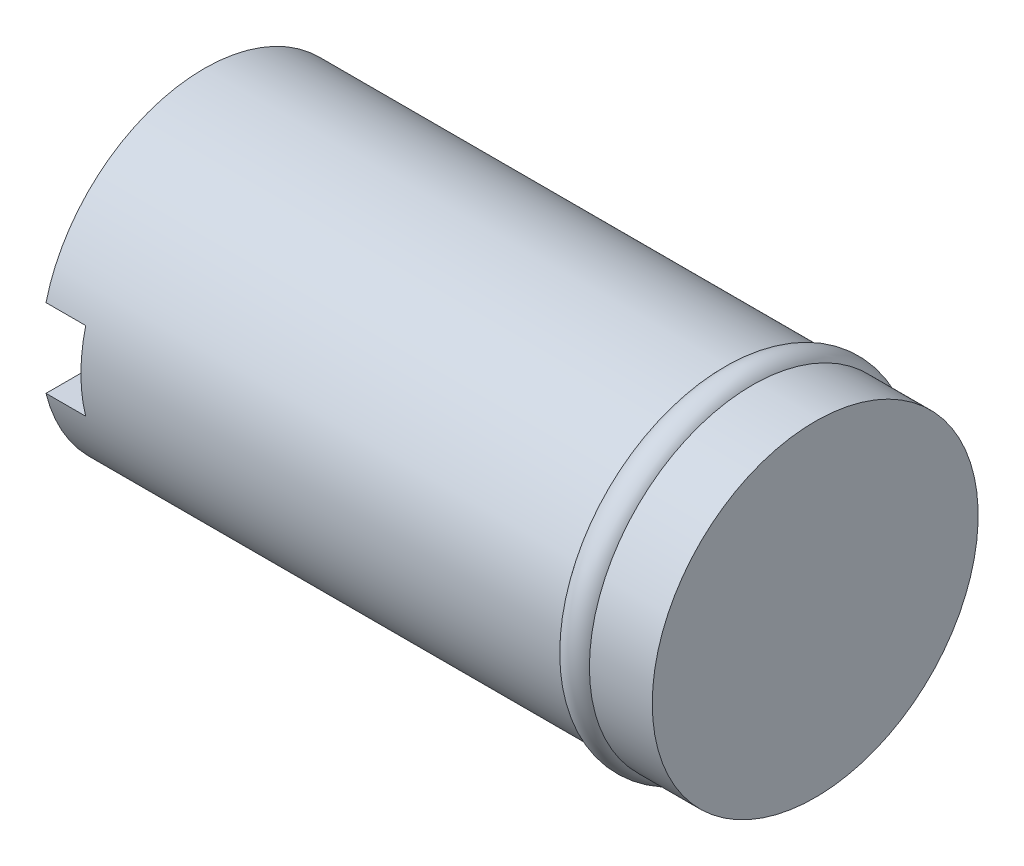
ISO-10303-21;
HEADER;
FILE_DESCRIPTION(('STEP AP214'),'2;1');
FILE_NAME('part.step','',(''),(''),'','','');
FILE_SCHEMA(('AUTOMOTIVE_DESIGN { 1 0 10303 214 1 1 1 1 }'));
ENDSEC;
DATA;
#1=APPLICATION_CONTEXT('core data for automotive mechanical design processes');
#2=APPLICATION_PROTOCOL_DEFINITION('international standard','automotive_design',2000,#1);
#3=PRODUCT_CONTEXT('',#1,'mechanical');
#4=PRODUCT('Part','Part','',(#3));
#5=PRODUCT_RELATED_PRODUCT_CATEGORY('part','',(#4));
#6=PRODUCT_DEFINITION_FORMATION('','',#4);
#7=PRODUCT_DEFINITION_CONTEXT('part definition',#1,'design');
#8=PRODUCT_DEFINITION('design','',#6,#7);
#9=PRODUCT_DEFINITION_SHAPE('','',#8);
#10=(LENGTH_UNIT() NAMED_UNIT(*) SI_UNIT(.MILLI.,.METRE.));
#11=(NAMED_UNIT(*) PLANE_ANGLE_UNIT() SI_UNIT($,.RADIAN.));
#12=(NAMED_UNIT(*) SI_UNIT($,.STERADIAN.) SOLID_ANGLE_UNIT());
#13=UNCERTAINTY_MEASURE_WITH_UNIT(LENGTH_MEASURE(1.E-05),#10,'distance_accuracy_value','');
#14=(GEOMETRIC_REPRESENTATION_CONTEXT(3) GLOBAL_UNCERTAINTY_ASSIGNED_CONTEXT((#13)) GLOBAL_UNIT_ASSIGNED_CONTEXT((#10,
#11,#12)) REPRESENTATION_CONTEXT('',''));
#15=CARTESIAN_POINT('',(0.,0.,0.));
#16=DIRECTION('',(0.,0.,1.));
#17=DIRECTION('',(1.,0.,0.));
#18=AXIS2_PLACEMENT_3D('',#15,#16,#17);
#19=CARTESIAN_POINT('',(0.,0.,0.));
#20=DIRECTION('',(1.,0.,0.));
#21=DIRECTION('',(0.,0.,-1.));
#22=AXIS2_PLACEMENT_3D('',#19,#20,#21);
#23=PLANE('',#22);
#24=CARTESIAN_POINT('',(0.,0.,0.));
#25=DIRECTION('',(-1.,0.,0.));
#26=DIRECTION('',(0.,0.,1.));
#27=AXIS2_PLACEMENT_3D('',#24,#25,#26);
#28=CIRCLE('',#27,4.);
#29=CARTESIAN_POINT('',(0.,-0.964181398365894,-3.8820554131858));
#30=VERTEX_POINT('',#29);
#31=CARTESIAN_POINT('',(0.,-0.964181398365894,3.8820554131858));
#32=VERTEX_POINT('',#31);
#33=EDGE_CURVE('E81',#30,#32,#28,.T.);
#34=ORIENTED_EDGE('',*,*,#33,.T.);
#35=DIRECTION('',(0.,0.,-1.));
#36=VECTOR('',#35,1.);
#37=CARTESIAN_POINT('',(0.,-0.964181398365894,0.));
#38=LINE('',#37,#36);
#39=EDGE_CURVE('E39',#32,#30,#38,.T.);
#40=ORIENTED_EDGE('',*,*,#39,.T.);
#41=EDGE_LOOP('',(#34,#40));
#42=FACE_BOUND('',#41,.T.);
#43=ADVANCED_FACE('F16',(#42),#23,.F.);
#44=CARTESIAN_POINT('',(0.,0.964181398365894,3.8820554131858));
#45=VERTEX_POINT('',#44);
#46=CARTESIAN_POINT('',(0.,0.964181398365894,-3.8820554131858));
#47=VERTEX_POINT('',#46);
#48=EDGE_CURVE('E80',#45,#47,#28,.T.);
#49=ORIENTED_EDGE('',*,*,#48,.T.);
#50=DIRECTION('',(0.,0.,1.));
#51=VECTOR('',#50,1.);
#52=CARTESIAN_POINT('',(0.,0.964181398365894,0.));
#53=LINE('',#52,#51);
#54=EDGE_CURVE('E58',#47,#45,#53,.T.);
#55=ORIENTED_EDGE('',*,*,#54,.T.);
#56=EDGE_LOOP('',(#49,#55));
#57=FACE_BOUND('',#56,.T.);
#58=ADVANCED_FACE('F18',(#57),#23,.F.);
#59=CARTESIAN_POINT('',(0.,0.,0.));
#60=DIRECTION('',(-1.,0.,0.));
#61=DIRECTION('',(0.,0.,1.));
#62=AXIS2_PLACEMENT_3D('',#59,#60,#61);
#63=CYLINDRICAL_SURFACE('',#62,4.);
#64=ORIENTED_EDGE('',*,*,#33,.F.);
#65=DIRECTION('',(-1.,0.,0.));
#66=VECTOR('',#65,1.);
#67=CARTESIAN_POINT('',(0.,-0.964181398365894,-3.8820554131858));
#68=LINE('',#67,#66);
#69=CARTESIAN_POINT('',(0.974420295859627,-0.964181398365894,-3.8820554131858));
#70=VERTEX_POINT('',#69);
#71=EDGE_CURVE('E10',#30,#70,#68,.F.);
#72=ORIENTED_EDGE('',*,*,#71,.T.);
#73=CARTESIAN_POINT('',(0.974420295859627,0.,0.));
#74=DIRECTION('',(1.,0.,0.));
#75=DIRECTION('',(0.,0.,-1.));
#76=AXIS2_PLACEMENT_3D('',#73,#74,#75);
#77=CIRCLE('',#76,4.);
#78=CARTESIAN_POINT('',(0.974420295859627,0.964181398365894,-3.8820554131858));
#79=VERTEX_POINT('',#78);
#80=EDGE_CURVE('E24',#70,#79,#77,.T.);
#81=ORIENTED_EDGE('',*,*,#80,.T.);
#82=DIRECTION('',(-1.,0.,0.));
#83=VECTOR('',#82,1.);
#84=CARTESIAN_POINT('',(0.,0.964181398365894,-3.8820554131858));
#85=LINE('',#84,#83);
#86=EDGE_CURVE('E55',#79,#47,#85,.T.);
#87=ORIENTED_EDGE('',*,*,#86,.T.);
#88=ORIENTED_EDGE('',*,*,#48,.F.);
#89=DIRECTION('',(-1.,0.,0.));
#90=VECTOR('',#89,1.);
#91=CARTESIAN_POINT('',(0.,0.964181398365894,3.8820554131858));
#92=LINE('',#91,#90);
#93=CARTESIAN_POINT('',(0.974420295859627,0.964181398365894,3.8820554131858));
#94=VERTEX_POINT('',#93);
#95=EDGE_CURVE('E79',#45,#94,#92,.F.);
#96=ORIENTED_EDGE('',*,*,#95,.T.);
#97=CARTESIAN_POINT('',(0.974420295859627,-0.964181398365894,3.8820554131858));
#98=VERTEX_POINT('',#97);
#99=EDGE_CURVE('E69',#94,#98,#77,.T.);
#100=ORIENTED_EDGE('',*,*,#99,.T.);
#101=DIRECTION('',(-1.,0.,0.));
#102=VECTOR('',#101,1.);
#103=CARTESIAN_POINT('',(0.,-0.964181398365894,3.8820554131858));
#104=LINE('',#103,#102);
#105=EDGE_CURVE('E63',#98,#32,#104,.T.);
#106=ORIENTED_EDGE('',*,*,#105,.T.);
#107=EDGE_LOOP('',(#64,#72,#81,#87,#88,#96,#100,#106));
#108=FACE_BOUND('',#107,.T.);
#109=CARTESIAN_POINT('',(12.7392093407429,0.,0.));
#110=DIRECTION('',(-1.,0.,0.));
#111=DIRECTION('',(0.,0.,1.));
#112=AXIS2_PLACEMENT_3D('',#109,#110,#111);
#113=CIRCLE('',#112,4.);
#114=CARTESIAN_POINT('',(12.7392093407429,0.,4.));
#115=VERTEX_POINT('',#114);
#116=EDGE_CURVE('E84',#115,#115,#113,.T.);
#117=ORIENTED_EDGE('',*,*,#116,.T.);
#118=EDGE_LOOP('',(#117));
#119=FACE_BOUND('',#118,.T.);
#120=ADVANCED_FACE('F74',(#108,#119),#63,.T.);
#121=CARTESIAN_POINT('',(13.0981836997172,0.,0.));
#122=DIRECTION('',(-1.,0.,0.));
#123=DIRECTION('',(0.,0.,1.));
#124=AXIS2_PLACEMENT_3D('',#121,#122,#123);
#125=TOROIDAL_SURFACE('',#124,3.75215608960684,0.43622149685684);
#126=ORIENTED_EDGE('',*,*,#116,.F.);
#127=EDGE_LOOP('',(#126));
#128=FACE_BOUND('',#127,.T.);
#129=CARTESIAN_POINT('',(13.4571580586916,0.,0.));
#130=DIRECTION('',(-1.,0.,0.));
#131=DIRECTION('',(0.,0.,1.));
#132=AXIS2_PLACEMENT_3D('',#129,#130,#131);
#133=CIRCLE('',#132,4.);
#134=CARTESIAN_POINT('',(13.4571580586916,0.,4.));
#135=VERTEX_POINT('',#134);
#136=EDGE_CURVE('E87',#135,#135,#133,.T.);
#137=ORIENTED_EDGE('',*,*,#136,.T.);
#138=EDGE_LOOP('',(#137));
#139=FACE_BOUND('',#138,.T.);
#140=ADVANCED_FACE('F109',(#128,#139),#125,.T.);
#141=CARTESIAN_POINT('',(0.,0.,0.));
#142=DIRECTION('',(-1.,0.,0.));
#143=DIRECTION('',(0.,0.,1.));
#144=AXIS2_PLACEMENT_3D('',#141,#142,#143);
#145=CYLINDRICAL_SURFACE('',#144,4.);
#146=ORIENTED_EDGE('',*,*,#136,.F.);
#147=EDGE_LOOP('',(#146));
#148=FACE_BOUND('',#147,.T.);
#149=CARTESIAN_POINT('',(15.,0.,0.));
#150=DIRECTION('',(-1.,0.,0.));
#151=DIRECTION('',(0.,0.,1.));
#152=AXIS2_PLACEMENT_3D('',#149,#150,#151);
#153=CIRCLE('',#152,4.);
#154=CARTESIAN_POINT('',(15.,0.,4.));
#155=VERTEX_POINT('',#154);
#156=EDGE_CURVE('E90',#155,#155,#153,.T.);
#157=ORIENTED_EDGE('',*,*,#156,.T.);
#158=EDGE_LOOP('',(#157));
#159=FACE_BOUND('',#158,.T.);
#160=ADVANCED_FACE('F114',(#148,#159),#145,.T.);
#161=CARTESIAN_POINT('',(15.,4.,0.));
#162=DIRECTION('',(-1.,0.,0.));
#163=DIRECTION('',(0.,0.,1.));
#164=AXIS2_PLACEMENT_3D('',#161,#162,#163);
#165=PLANE('',#164);
#166=ORIENTED_EDGE('',*,*,#156,.F.);
#167=EDGE_LOOP('',(#166));
#168=FACE_BOUND('',#167,.T.);
#169=ADVANCED_FACE('F120',(#168),#165,.F.);
#170=CARTESIAN_POINT('',(0.974420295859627,-0.964181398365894,-4.18837758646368));
#171=DIRECTION('',(1.,0.,0.));
#172=DIRECTION('',(0.,0.,-1.));
#173=AXIS2_PLACEMENT_3D('',#170,#171,#172);
#174=PLANE('',#173);
#175=DIRECTION('',(0.,0.,1.));
#176=VECTOR('',#175,1.);
#177=CARTESIAN_POINT('',(0.974420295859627,0.964181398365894,-4.18837758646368));
#178=LINE('',#177,#176);
#179=EDGE_CURVE('E31',#79,#94,#178,.T.);
#180=ORIENTED_EDGE('',*,*,#179,.F.);
#181=ORIENTED_EDGE('',*,*,#80,.F.);
#182=DIRECTION('',(0.,0.,1.));
#183=VECTOR('',#182,1.);
#184=CARTESIAN_POINT('',(0.974420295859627,-0.964181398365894,-4.18837758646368));
#185=LINE('',#184,#183);
#186=EDGE_CURVE('E71',#70,#98,#185,.T.);
#187=ORIENTED_EDGE('',*,*,#186,.T.);
#188=ORIENTED_EDGE('',*,*,#99,.F.);
#189=EDGE_LOOP('',(#180,#181,#187,#188));
#190=FACE_BOUND('',#189,.T.);
#191=ADVANCED_FACE('F65',(#190),#174,.F.);
#192=CARTESIAN_POINT('',(-0.974420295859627,-0.964181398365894,-4.18837758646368));
#193=DIRECTION('',(0.,-1.,0.));
#194=DIRECTION('',(0.,0.,-1.));
#195=AXIS2_PLACEMENT_3D('',#192,#193,#194);
#196=PLANE('',#195);
#197=ORIENTED_EDGE('',*,*,#186,.F.);
#198=ORIENTED_EDGE('',*,*,#71,.F.);
#199=ORIENTED_EDGE('',*,*,#39,.F.);
#200=ORIENTED_EDGE('',*,*,#105,.F.);
#201=EDGE_LOOP('',(#197,#198,#199,#200));
#202=FACE_BOUND('',#201,.T.);
#203=ADVANCED_FACE('F95',(#202),#196,.F.);
#204=CARTESIAN_POINT('',(-0.974420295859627,0.964181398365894,-4.18837758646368));
#205=DIRECTION('',(0.,1.,0.));
#206=DIRECTION('',(0.,0.,1.));
#207=AXIS2_PLACEMENT_3D('',#204,#205,#206);
#208=PLANE('',#207);
#209=ORIENTED_EDGE('',*,*,#179,.T.);
#210=ORIENTED_EDGE('',*,*,#95,.F.);
#211=ORIENTED_EDGE('',*,*,#54,.F.);
#212=ORIENTED_EDGE('',*,*,#86,.F.);
#213=EDGE_LOOP('',(#209,#210,#211,#212));
#214=FACE_BOUND('',#213,.T.);
#215=ADVANCED_FACE('F56',(#214),#208,.F.);
#216=CLOSED_SHELL('',(#43,#58,#120,#140,#160,#169,#191,#203,#215));
#217=MANIFOLD_SOLID_BREP('B1',#216);
#218=ADVANCED_BREP_SHAPE_REPRESENTATION('',(#18,#217),#14);
#219=SHAPE_DEFINITION_REPRESENTATION(#9,#218);
ENDSEC;
END-ISO-10303-21;
